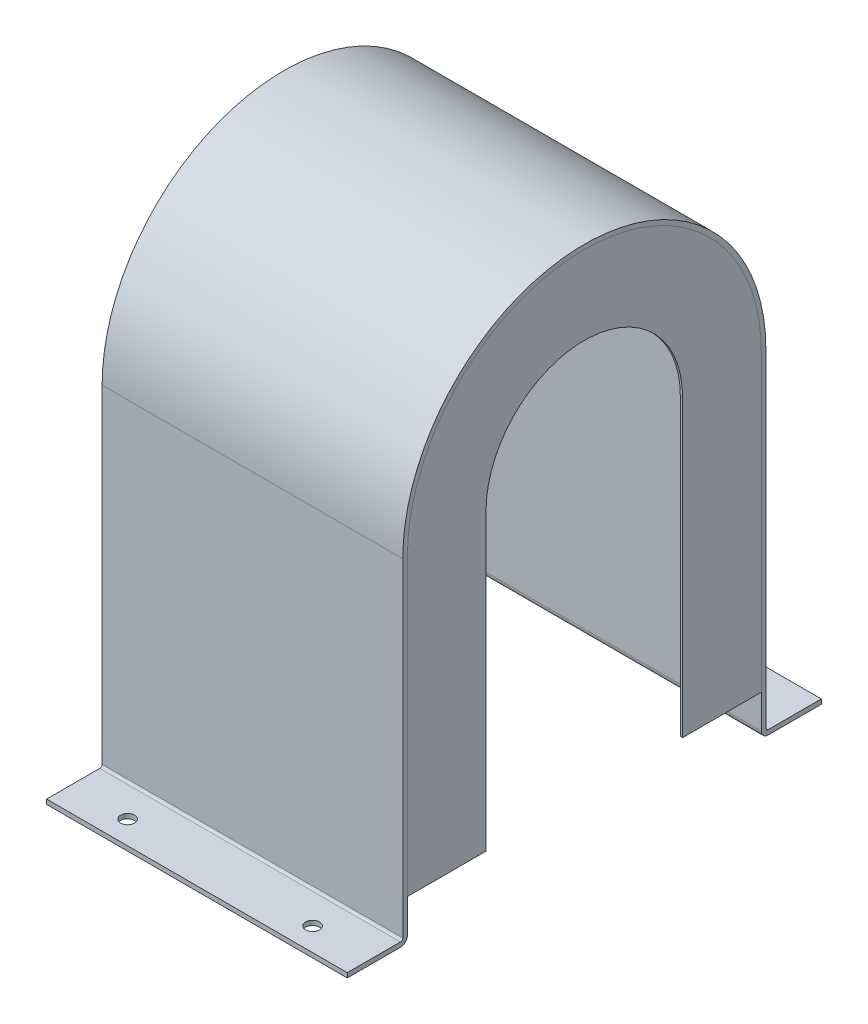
from build123d import *

# Parameters (mm, degrees)
BOSS_EXTRUDE1_DEPTH = 130
SKETCH2_R           = 85
BOSS_EXTRUDE2_DEPTH = 2
SKETCH3_R           = 6
CUT_EXTRUDE1_DEPTH  = 506.147503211
SKETCH4_W           = 170
SKETCH4_H           = 255
CUT_EXTRUDE2_DEPTH  = 441.142022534


with BuildPart() as part:
    # Sketch1 → Boss-Extrude1 (new, symmetric)
    with BuildSketch(Plane(origin=(0, 0, 0), x_dir=(0, 0, -1), z_dir=(1, 0, 0))):
        with BuildLine():
            Line((157, 0), (157, -284))
            ThreePointArc((157, -284), (157.585786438, -285.414213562), (159, -286))
            Line((159, -286), (205, -286))
            Line((205, -286), (205, -290))
            Line((205, -290), (159, -290))
            ThreePointArc((159, -290), (154.757359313, -288.242640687), (153, -284))
            Line((153, -284), (153, 0))
            ThreePointArc((153, 0), (0, 153), (-153, 0))
            Line((-153, 0), (-153, -284))
            ThreePointArc((-153, -284), (-154.757359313, -288.242640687), (-159, -290))
            Line((-159, -290), (-205, -290))
            Line((-205, -290), (-205, -286))
            Line((-205, -286), (-159, -286))
            ThreePointArc((-159, -286), (-157.585786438, -285.414213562), (-157, -284))
            Line((-157, -284), (-157, 0))
            ThreePointArc((-157, 0), (0, 157), (157, 0))
        make_face()
    extrude(amount=BOSS_EXTRUDE1_DEPTH, both=True)

    # Sketch3 → Cut-Extrude1 (cut, through all)
    with BuildSketch(Plane(origin=(0, -286, 0), x_dir=(1, 0, 0), z_dir=(0, 1, 0))):
        with Locations(Location((-80, -185, 0), (0, 0, 270))):
            Circle(SKETCH3_R)
        with Locations(Location((80, -185, 0), (0, 0, 270))):
            Circle(SKETCH3_R)
    cut_extrude1 = extrude(amount=-CUT_EXTRUDE1_DEPTH, mode=Mode.SUBTRACT)

    # Mirror5: Cut-Extrude1 across plane
    add(cut_extrude1.mirror(Plane.XY), mode=Mode.SUBTRACT)


with BuildPart() as body_2:
    # Sketch2 → Boss-Extrude2 (new body)
    with BuildSketch(Plane(origin=(130, 0, 0), x_dir=(0, 0, -1), z_dir=(1, 0, 0))):
        with BuildLine():
            Line((-153, 0), (-153, -255))
            Line((-153, -255), (153, -255))
            Line((153, -255), (153, 0))
            ThreePointArc((153, 0), (0, 153), (-153, 0))
        make_face()
        Circle(SKETCH2_R, mode=Mode.SUBTRACT)
    extrude(amount=-BOSS_EXTRUDE2_DEPTH)


with BuildPart() as body_3:
    # Mirror4: mirrored copy
    add(body_2.part.mirror(Plane(origin=(0, 0, 0), x_dir=(0, 0, 1), z_dir=(1, 0, 0))))


with BuildPart() as cut_extrude2_tool:
    # Sketch4 → Cut-Extrude2 (new, through all)
    with BuildSketch(Plane.ZY.offset(130)):
        with Locations((0, -127.5)):
            Rectangle(SKETCH4_W, SKETCH4_H)
    extrude(amount=-CUT_EXTRUDE2_DEPTH)


with BuildPart() as body_2_1:
    add(body_2.part)

    # Cut-Extrude2: cut by cut_extrude2_tool
    add(cut_extrude2_tool.part, mode=Mode.SUBTRACT)


with BuildPart() as body_3_1:
    add(body_3.part)

    # Cut-Extrude2: cut by cut_extrude2_tool
    add(cut_extrude2_tool.part, mode=Mode.SUBTRACT)


solid = Compound([part.part, body_2_1.part, body_3_1.part])
